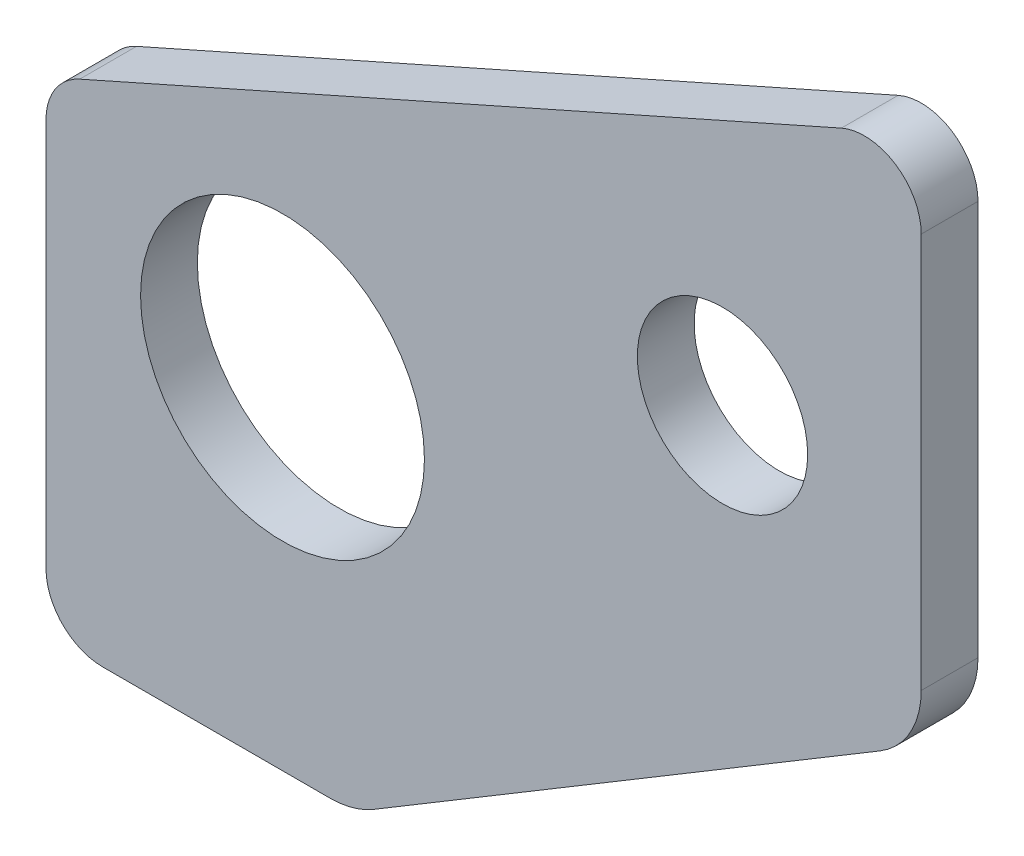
ISO-10303-21;
HEADER;
FILE_DESCRIPTION(('STEP AP214'),'2;1');
FILE_NAME('part.step','',(''),(''),'','','');
FILE_SCHEMA(('AUTOMOTIVE_DESIGN { 1 0 10303 214 1 1 1 1 }'));
ENDSEC;
DATA;
#1=APPLICATION_CONTEXT('core data for automotive mechanical design processes');
#2=APPLICATION_PROTOCOL_DEFINITION('international standard','automotive_design',2000,#1);
#3=PRODUCT_CONTEXT('',#1,'mechanical');
#4=PRODUCT('Part','Part','',(#3));
#5=PRODUCT_RELATED_PRODUCT_CATEGORY('part','',(#4));
#6=PRODUCT_DEFINITION_FORMATION('','',#4);
#7=PRODUCT_DEFINITION_CONTEXT('part definition',#1,'design');
#8=PRODUCT_DEFINITION('design','',#6,#7);
#9=PRODUCT_DEFINITION_SHAPE('','',#8);
#10=(LENGTH_UNIT() NAMED_UNIT(*) SI_UNIT(.MILLI.,.METRE.));
#11=(NAMED_UNIT(*) PLANE_ANGLE_UNIT() SI_UNIT($,.RADIAN.));
#12=(NAMED_UNIT(*) SI_UNIT($,.STERADIAN.) SOLID_ANGLE_UNIT());
#13=UNCERTAINTY_MEASURE_WITH_UNIT(LENGTH_MEASURE(1.E-05),#10,'distance_accuracy_value','');
#14=(GEOMETRIC_REPRESENTATION_CONTEXT(3) GLOBAL_UNCERTAINTY_ASSIGNED_CONTEXT((#13)) GLOBAL_UNIT_ASSIGNED_CONTEXT((#10,
#11,#12)) REPRESENTATION_CONTEXT('',''));
#15=CARTESIAN_POINT('',(0.,0.,0.));
#16=DIRECTION('',(0.,0.,1.));
#17=DIRECTION('',(1.,0.,0.));
#18=AXIS2_PLACEMENT_3D('',#15,#16,#17);
#19=CARTESIAN_POINT('',(-4.44619602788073,34.2489986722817,-2.));
#20=DIRECTION('',(0.,0.,1.));
#21=DIRECTION('',(1.,0.,0.));
#22=AXIS2_PLACEMENT_3D('',#19,#20,#21);
#23=CYLINDRICAL_SURFACE('',#22,3.00000000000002);
#24=CARTESIAN_POINT('',(-4.44619602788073,34.2489986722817,0.));
#25=DIRECTION('',(0.,0.,1.));
#26=DIRECTION('',(-1.,0.,0.));
#27=AXIS2_PLACEMENT_3D('',#24,#25,#26);
#28=CIRCLE('',#27,3.00000000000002);
#29=CARTESIAN_POINT('',(-4.44619602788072,31.2489986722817,0.));
#30=VERTEX_POINT('',#29);
#31=CARTESIAN_POINT('',(-2.90270876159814,31.676519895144,0.));
#32=VERTEX_POINT('',#31);
#33=EDGE_CURVE('E139',#30,#32,#28,.T.);
#34=ORIENTED_EDGE('',*,*,#33,.F.);
#35=DIRECTION('',(0.,0.,1.));
#36=VECTOR('',#35,1.);
#37=CARTESIAN_POINT('',(-4.44619602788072,31.2489986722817,-2.));
#38=LINE('',#37,#36);
#39=CARTESIAN_POINT('',(-4.44619602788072,31.2489986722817,-2.));
#40=VERTEX_POINT('',#39);
#41=EDGE_CURVE('E11',#40,#30,#38,.T.);
#42=ORIENTED_EDGE('',*,*,#41,.F.);
#43=CARTESIAN_POINT('',(-4.44619602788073,34.2489986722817,-2.));
#44=DIRECTION('',(0.,0.,1.));
#45=DIRECTION('',(-1.,0.,0.));
#46=AXIS2_PLACEMENT_3D('',#43,#44,#45);
#47=CIRCLE('',#46,3.00000000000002);
#48=CARTESIAN_POINT('',(-2.90270876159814,31.676519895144,-2.));
#49=VERTEX_POINT('',#48);
#50=EDGE_CURVE('E166',#40,#49,#47,.T.);
#51=ORIENTED_EDGE('',*,*,#50,.T.);
#52=DIRECTION('',(0.,0.,1.));
#53=VECTOR('',#52,1.);
#54=CARTESIAN_POINT('',(-2.90270876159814,31.676519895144,-2.));
#55=LINE('',#54,#53);
#56=EDGE_CURVE('E33',#49,#32,#55,.T.);
#57=ORIENTED_EDGE('',*,*,#56,.T.);
#58=EDGE_LOOP('',(#34,#42,#51,#57));
#59=FACE_BOUND('',#58,.T.);
#60=ADVANCED_FACE('F30',(#59),#23,.T.);
#61=CARTESIAN_POINT('',(-12.4461960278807,31.2489986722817,-2.));
#62=DIRECTION('',(0.,-1.,0.));
#63=DIRECTION('',(0.,0.,-1.));
#64=AXIS2_PLACEMENT_3D('',#61,#62,#63);
#65=PLANE('',#64);
#66=DIRECTION('',(1.,0.,0.));
#67=VECTOR('',#66,1.);
#68=CARTESIAN_POINT('',(-12.4461960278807,31.2489986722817,0.));
#69=LINE('',#68,#67);
#70=CARTESIAN_POINT('',(-12.4461960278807,31.2489986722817,0.));
#71=VERTEX_POINT('',#70);
#72=EDGE_CURVE('E164',#71,#30,#69,.T.);
#73=ORIENTED_EDGE('',*,*,#72,.F.);
#74=DIRECTION('',(0.,0.,1.));
#75=VECTOR('',#74,1.);
#76=CARTESIAN_POINT('',(-12.4461960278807,31.2489986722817,-2.));
#77=LINE('',#76,#75);
#78=CARTESIAN_POINT('',(-12.4461960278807,31.2489986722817,-2.));
#79=VERTEX_POINT('',#78);
#80=EDGE_CURVE('E39',#79,#71,#77,.T.);
#81=ORIENTED_EDGE('',*,*,#80,.F.);
#82=DIRECTION('',(1.,0.,0.));
#83=VECTOR('',#82,1.);
#84=CARTESIAN_POINT('',(-12.4461960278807,31.2489986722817,-2.));
#85=LINE('',#84,#83);
#86=EDGE_CURVE('E129',#79,#40,#85,.T.);
#87=ORIENTED_EDGE('',*,*,#86,.T.);
#88=ORIENTED_EDGE('',*,*,#41,.T.);
#89=EDGE_LOOP('',(#73,#81,#87,#88));
#90=FACE_BOUND('',#89,.T.);
#91=ADVANCED_FACE('F182',(#90),#65,.T.);
#92=CARTESIAN_POINT('',(-12.4461960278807,33.2489986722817,-2.));
#93=DIRECTION('',(0.,0.,1.));
#94=DIRECTION('',(1.,0.,0.));
#95=AXIS2_PLACEMENT_3D('',#92,#93,#94);
#96=CYLINDRICAL_SURFACE('',#95,2.00000000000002);
#97=CARTESIAN_POINT('',(-12.4461960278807,33.2489986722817,0.));
#98=DIRECTION('',(0.,0.,1.));
#99=DIRECTION('',(1.,0.,0.));
#100=AXIS2_PLACEMENT_3D('',#97,#98,#99);
#101=CIRCLE('',#100,2.00000000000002);
#102=CARTESIAN_POINT('',(-14.4461960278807,33.2489986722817,0.));
#103=VERTEX_POINT('',#102);
#104=EDGE_CURVE('E116',#103,#71,#101,.T.);
#105=ORIENTED_EDGE('',*,*,#104,.F.);
#106=DIRECTION('',(0.,0.,1.));
#107=VECTOR('',#106,1.);
#108=CARTESIAN_POINT('',(-14.4461960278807,33.2489986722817,-2.));
#109=LINE('',#108,#107);
#110=CARTESIAN_POINT('',(-14.4461960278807,33.2489986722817,-2.));
#111=VERTEX_POINT('',#110);
#112=EDGE_CURVE('E111',#111,#103,#109,.T.);
#113=ORIENTED_EDGE('',*,*,#112,.F.);
#114=CARTESIAN_POINT('',(-12.4461960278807,33.2489986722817,-2.));
#115=DIRECTION('',(0.,0.,1.));
#116=DIRECTION('',(1.,0.,0.));
#117=AXIS2_PLACEMENT_3D('',#114,#115,#116);
#118=CIRCLE('',#117,2.00000000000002);
#119=EDGE_CURVE('E114',#111,#79,#118,.T.);
#120=ORIENTED_EDGE('',*,*,#119,.T.);
#121=ORIENTED_EDGE('',*,*,#80,.T.);
#122=EDGE_LOOP('',(#105,#113,#120,#121));
#123=FACE_BOUND('',#122,.T.);
#124=ADVANCED_FACE('F113',(#123),#96,.T.);
#125=CARTESIAN_POINT('',(-14.4461960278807,46.9490955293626,-2.));
#126=DIRECTION('',(-1.,0.,0.));
#127=DIRECTION('',(0.,0.,1.));
#128=AXIS2_PLACEMENT_3D('',#125,#126,#127);
#129=PLANE('',#128);
#130=DIRECTION('',(0.,-1.,0.));
#131=VECTOR('',#130,1.);
#132=CARTESIAN_POINT('',(-14.4461960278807,46.9490955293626,0.));
#133=LINE('',#132,#131);
#134=CARTESIAN_POINT('',(-14.4461960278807,46.9490955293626,0.));
#135=VERTEX_POINT('',#134);
#136=EDGE_CURVE('E161',#135,#103,#133,.T.);
#137=ORIENTED_EDGE('',*,*,#136,.F.);
#138=DIRECTION('',(0.,0.,1.));
#139=VECTOR('',#138,1.);
#140=CARTESIAN_POINT('',(-14.4461960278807,46.9490955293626,-2.));
#141=LINE('',#140,#139);
#142=CARTESIAN_POINT('',(-14.4461960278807,46.9490955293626,-2.));
#143=VERTEX_POINT('',#142);
#144=EDGE_CURVE('E121',#143,#135,#141,.T.);
#145=ORIENTED_EDGE('',*,*,#144,.F.);
#146=DIRECTION('',(0.,-1.,0.));
#147=VECTOR('',#146,1.);
#148=CARTESIAN_POINT('',(-14.4461960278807,46.9490955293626,-2.));
#149=LINE('',#148,#147);
#150=EDGE_CURVE('E127',#143,#111,#149,.T.);
#151=ORIENTED_EDGE('',*,*,#150,.T.);
#152=ORIENTED_EDGE('',*,*,#112,.T.);
#153=EDGE_LOOP('',(#137,#145,#151,#152));
#154=FACE_BOUND('',#153,.T.);
#155=ADVANCED_FACE('F131',(#154),#129,.T.);
#156=CARTESIAN_POINT('',(-12.4461960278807,46.9490955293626,-2.));
#157=DIRECTION('',(0.,0.,1.));
#158=DIRECTION('',(1.,0.,0.));
#159=AXIS2_PLACEMENT_3D('',#156,#157,#158);
#160=CYLINDRICAL_SURFACE('',#159,2.00000000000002);
#161=CARTESIAN_POINT('',(-12.4461960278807,46.9490955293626,0.));
#162=DIRECTION('',(0.,0.,1.));
#163=DIRECTION('',(1.,0.,0.));
#164=AXIS2_PLACEMENT_3D('',#161,#162,#163);
#165=CIRCLE('',#164,2.00000000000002);
#166=CARTESIAN_POINT('',(-13.2582712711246,48.7768082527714,0.));
#167=VERTEX_POINT('',#166);
#168=EDGE_CURVE('E158',#167,#135,#165,.T.);
#169=ORIENTED_EDGE('',*,*,#168,.F.);
#170=DIRECTION('',(0.,0.,1.));
#171=VECTOR('',#170,1.);
#172=CARTESIAN_POINT('',(-13.2582712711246,48.7768082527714,-2.));
#173=LINE('',#172,#171);
#174=CARTESIAN_POINT('',(-13.2582712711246,48.7768082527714,-2.));
#175=VERTEX_POINT('',#174);
#176=EDGE_CURVE('E170',#175,#167,#173,.T.);
#177=ORIENTED_EDGE('',*,*,#176,.F.);
#178=CARTESIAN_POINT('',(-12.4461960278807,46.9490955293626,-2.));
#179=DIRECTION('',(0.,0.,1.));
#180=DIRECTION('',(1.,0.,0.));
#181=AXIS2_PLACEMENT_3D('',#178,#179,#180);
#182=CIRCLE('',#181,2.00000000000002);
#183=EDGE_CURVE('E132',#175,#143,#182,.T.);
#184=ORIENTED_EDGE('',*,*,#183,.T.);
#185=ORIENTED_EDGE('',*,*,#144,.T.);
#186=EDGE_LOOP('',(#169,#177,#184,#185));
#187=FACE_BOUND('',#186,.T.);
#188=ADVANCED_FACE('F195',(#187),#160,.T.);
#189=CARTESIAN_POINT('',(13.5726806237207,60.6981301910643,-2.));
#190=DIRECTION('',(-0.406037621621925,0.913856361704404,0.));
#191=DIRECTION('',(-0.913856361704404,-0.406037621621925,0.));
#192=AXIS2_PLACEMENT_3D('',#189,#190,#191);
#193=PLANE('',#192);
#194=DIRECTION('',(-0.913856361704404,-0.406037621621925,0.));
#195=VECTOR('',#194,1.);
#196=CARTESIAN_POINT('',(13.5726806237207,60.6981301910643,0.));
#197=LINE('',#196,#195);
#198=CARTESIAN_POINT('',(13.5726806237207,60.6981301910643,0.));
#199=VERTEX_POINT('',#198);
#200=EDGE_CURVE('E155',#199,#167,#197,.T.);
#201=ORIENTED_EDGE('',*,*,#200,.F.);
#202=DIRECTION('',(0.,0.,1.));
#203=VECTOR('',#202,1.);
#204=CARTESIAN_POINT('',(13.5726806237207,60.6981301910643,-2.));
#205=LINE('',#204,#203);
#206=CARTESIAN_POINT('',(13.5726806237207,60.6981301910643,-2.));
#207=VERTEX_POINT('',#206);
#208=EDGE_CURVE('E172',#207,#199,#205,.T.);
#209=ORIENTED_EDGE('',*,*,#208,.F.);
#210=DIRECTION('',(-0.913856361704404,-0.406037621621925,0.));
#211=VECTOR('',#210,1.);
#212=CARTESIAN_POINT('',(13.5726806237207,60.6981301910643,-2.));
#213=LINE('',#212,#211);
#214=EDGE_CURVE('E134',#207,#175,#213,.T.);
#215=ORIENTED_EDGE('',*,*,#214,.T.);
#216=ORIENTED_EDGE('',*,*,#176,.T.);
#217=EDGE_LOOP('',(#201,#209,#215,#216));
#218=FACE_BOUND('',#217,.T.);
#219=ADVANCED_FACE('F198',(#218),#193,.T.);
#220=CARTESIAN_POINT('',(14.3847558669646,58.8704174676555,-2.));
#221=DIRECTION('',(0.,0.,1.));
#222=DIRECTION('',(1.,0.,0.));
#223=AXIS2_PLACEMENT_3D('',#220,#221,#222);
#224=CYLINDRICAL_SURFACE('',#223,2.00000000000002);
#225=CARTESIAN_POINT('',(14.3847558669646,58.8704174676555,0.));
#226=DIRECTION('',(0.,0.,1.));
#227=DIRECTION('',(-1.,0.,0.));
#228=AXIS2_PLACEMENT_3D('',#225,#226,#227);
#229=CIRCLE('',#228,2.00000000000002);
#230=CARTESIAN_POINT('',(16.3847558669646,58.8704174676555,0.));
#231=VERTEX_POINT('',#230);
#232=EDGE_CURVE('E152',#231,#199,#229,.T.);
#233=ORIENTED_EDGE('',*,*,#232,.F.);
#234=DIRECTION('',(0.,0.,1.));
#235=VECTOR('',#234,1.);
#236=CARTESIAN_POINT('',(16.3847558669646,58.8704174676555,-2.));
#237=LINE('',#236,#235);
#238=CARTESIAN_POINT('',(16.3847558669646,58.8704174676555,-2.));
#239=VERTEX_POINT('',#238);
#240=EDGE_CURVE('E174',#239,#231,#237,.T.);
#241=ORIENTED_EDGE('',*,*,#240,.F.);
#242=CARTESIAN_POINT('',(14.3847558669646,58.8704174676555,-2.));
#243=DIRECTION('',(0.,0.,1.));
#244=DIRECTION('',(-1.,0.,0.));
#245=AXIS2_PLACEMENT_3D('',#242,#243,#244);
#246=CIRCLE('',#245,2.00000000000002);
#247=EDGE_CURVE('E258',#239,#207,#246,.T.);
#248=ORIENTED_EDGE('',*,*,#247,.T.);
#249=ORIENTED_EDGE('',*,*,#208,.T.);
#250=EDGE_LOOP('',(#233,#241,#248,#249));
#251=FACE_BOUND('',#250,.T.);
#252=ADVANCED_FACE('F202',(#251),#224,.T.);
#253=CARTESIAN_POINT('',(16.3847558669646,58.8704174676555,-2.));
#254=DIRECTION('',(1.,0.,0.));
#255=DIRECTION('',(0.,0.,-1.));
#256=AXIS2_PLACEMENT_3D('',#253,#254,#255);
#257=PLANE('',#256);
#258=DIRECTION('',(0.,1.,0.));
#259=VECTOR('',#258,1.);
#260=CARTESIAN_POINT('',(16.3847558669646,58.8704174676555,0.));
#261=LINE('',#260,#259);
#262=CARTESIAN_POINT('',(16.3847558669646,44.9475698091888,0.));
#263=VERTEX_POINT('',#262);
#264=EDGE_CURVE('E149',#263,#231,#261,.T.);
#265=ORIENTED_EDGE('',*,*,#264,.F.);
#266=DIRECTION('',(0.,0.,1.));
#267=VECTOR('',#266,1.);
#268=CARTESIAN_POINT('',(16.3847558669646,44.9475698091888,-2.));
#269=LINE('',#268,#267);
#270=CARTESIAN_POINT('',(16.3847558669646,44.9475698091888,-2.));
#271=VERTEX_POINT('',#270);
#272=EDGE_CURVE('E176',#271,#263,#269,.T.);
#273=ORIENTED_EDGE('',*,*,#272,.F.);
#274=DIRECTION('',(0.,1.,0.));
#275=VECTOR('',#274,1.);
#276=CARTESIAN_POINT('',(16.3847558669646,58.8704174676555,-2.));
#277=LINE('',#276,#275);
#278=EDGE_CURVE('E255',#271,#239,#277,.T.);
#279=ORIENTED_EDGE('',*,*,#278,.T.);
#280=ORIENTED_EDGE('',*,*,#240,.T.);
#281=EDGE_LOOP('',(#265,#273,#279,#280));
#282=FACE_BOUND('',#281,.T.);
#283=ADVANCED_FACE('F206',(#282),#257,.T.);
#284=CARTESIAN_POINT('',(13.3847558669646,44.9475698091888,-2.));
#285=DIRECTION('',(0.,0.,1.));
#286=DIRECTION('',(1.,0.,0.));
#287=AXIS2_PLACEMENT_3D('',#284,#285,#286);
#288=CYLINDRICAL_SURFACE('',#287,3.00000000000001);
#289=CARTESIAN_POINT('',(13.3847558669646,44.9475698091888,0.));
#290=DIRECTION('',(0.,0.,1.));
#291=DIRECTION('',(-1.,0.,0.));
#292=AXIS2_PLACEMENT_3D('',#289,#290,#291);
#293=CIRCLE('',#292,3.00000000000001);
#294=CARTESIAN_POINT('',(14.9282431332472,42.3750910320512,0.));
#295=VERTEX_POINT('',#294);
#296=EDGE_CURVE('E146',#295,#263,#293,.T.);
#297=ORIENTED_EDGE('',*,*,#296,.F.);
#298=DIRECTION('',(0.,0.,1.));
#299=VECTOR('',#298,1.);
#300=CARTESIAN_POINT('',(14.9282431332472,42.3750910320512,-2.));
#301=LINE('',#300,#299);
#302=CARTESIAN_POINT('',(14.9282431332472,42.3750910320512,-2.));
#303=VERTEX_POINT('',#302);
#304=EDGE_CURVE('E177',#303,#295,#301,.T.);
#305=ORIENTED_EDGE('',*,*,#304,.F.);
#306=CARTESIAN_POINT('',(13.3847558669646,44.9475698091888,-2.));
#307=DIRECTION('',(0.,0.,1.));
#308=DIRECTION('',(-1.,0.,0.));
#309=AXIS2_PLACEMENT_3D('',#306,#307,#308);
#310=CIRCLE('',#309,3.00000000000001);
#311=EDGE_CURVE('E252',#303,#271,#310,.T.);
#312=ORIENTED_EDGE('',*,*,#311,.T.);
#313=ORIENTED_EDGE('',*,*,#272,.T.);
#314=EDGE_LOOP('',(#297,#305,#312,#313));
#315=FACE_BOUND('',#314,.T.);
#316=ADVANCED_FACE('F210',(#315),#288,.T.);
#317=CARTESIAN_POINT('',(-2.90270876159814,31.676519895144,-2.));
#318=DIRECTION('',(0.514495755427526,-0.857492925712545,0.));
#319=DIRECTION('',(0.857492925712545,0.514495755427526,0.));
#320=AXIS2_PLACEMENT_3D('',#317,#318,#319);
#321=PLANE('',#320);
#322=DIRECTION('',(0.857492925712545,0.514495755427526,0.));
#323=VECTOR('',#322,1.);
#324=CARTESIAN_POINT('',(-2.90270876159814,31.676519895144,0.));
#325=LINE('',#324,#323);
#326=EDGE_CURVE('E142',#32,#295,#325,.T.);
#327=ORIENTED_EDGE('',*,*,#326,.F.);
#328=ORIENTED_EDGE('',*,*,#56,.F.);
#329=DIRECTION('',(0.857492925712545,0.514495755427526,0.));
#330=VECTOR('',#329,1.);
#331=CARTESIAN_POINT('',(-2.90270876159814,31.676519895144,-2.));
#332=LINE('',#331,#330);
#333=EDGE_CURVE('E250',#49,#303,#332,.T.);
#334=ORIENTED_EDGE('',*,*,#333,.T.);
#335=ORIENTED_EDGE('',*,*,#304,.T.);
#336=EDGE_LOOP('',(#327,#328,#334,#335));
#337=FACE_BOUND('',#336,.T.);
#338=ADVANCED_FACE('F179',(#337),#321,.T.);
#339=CARTESIAN_POINT('',(-4.44619602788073,34.2489986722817,-2.));
#340=DIRECTION('',(0.,0.,-1.));
#341=DIRECTION('',(-1.,0.,0.));
#342=AXIS2_PLACEMENT_3D('',#339,#340,#341);
#343=PLANE('',#342);
#344=CARTESIAN_POINT('',(9.38475586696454,50.1437222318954,-2.));
#345=DIRECTION('',(0.,0.,1.));
#346=DIRECTION('',(1.,0.,0.));
#347=AXIS2_PLACEMENT_3D('',#344,#345,#346);
#348=CIRCLE('',#347,3.);
#349=CARTESIAN_POINT('',(12.3847558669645,50.1437222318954,-2.));
#350=VERTEX_POINT('',#349);
#351=EDGE_CURVE('E237',#350,#350,#348,.T.);
#352=ORIENTED_EDGE('',*,*,#351,.T.);
#353=EDGE_LOOP('',(#352));
#354=FACE_BOUND('',#353,.T.);
#355=CARTESIAN_POINT('',(-6.11524413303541,43.2489986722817,-2.));
#356=DIRECTION('',(0.,0.,1.));
#357=DIRECTION('',(1.,0.,0.));
#358=AXIS2_PLACEMENT_3D('',#355,#356,#357);
#359=CIRCLE('',#358,5.);
#360=CARTESIAN_POINT('',(-1.11524413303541,43.2489986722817,-2.));
#361=VERTEX_POINT('',#360);
#362=EDGE_CURVE('E143',#361,#361,#359,.T.);
#363=ORIENTED_EDGE('',*,*,#362,.T.);
#364=EDGE_LOOP('',(#363));
#365=FACE_BOUND('',#364,.T.);
#366=ORIENTED_EDGE('',*,*,#50,.F.);
#367=ORIENTED_EDGE('',*,*,#86,.F.);
#368=ORIENTED_EDGE('',*,*,#119,.F.);
#369=ORIENTED_EDGE('',*,*,#150,.F.);
#370=ORIENTED_EDGE('',*,*,#183,.F.);
#371=ORIENTED_EDGE('',*,*,#214,.F.);
#372=ORIENTED_EDGE('',*,*,#247,.F.);
#373=ORIENTED_EDGE('',*,*,#278,.F.);
#374=ORIENTED_EDGE('',*,*,#311,.F.);
#375=ORIENTED_EDGE('',*,*,#333,.F.);
#376=EDGE_LOOP('',(#366,#367,#368,#369,#370,#371,#372,#373,#374,#375));
#377=FACE_BOUND('',#376,.T.);
#378=ADVANCED_FACE('F125',(#354,#365,#377),#343,.T.);
#379=CARTESIAN_POINT('',(-4.44619602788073,34.2489986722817,0.));
#380=DIRECTION('',(0.,0.,-1.));
#381=DIRECTION('',(-1.,0.,0.));
#382=AXIS2_PLACEMENT_3D('',#379,#380,#381);
#383=PLANE('',#382);
#384=CARTESIAN_POINT('',(9.38475586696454,50.1437222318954,0.));
#385=DIRECTION('',(0.,0.,1.));
#386=DIRECTION('',(1.,0.,0.));
#387=AXIS2_PLACEMENT_3D('',#384,#385,#386);
#388=CIRCLE('',#387,3.);
#389=CARTESIAN_POINT('',(12.3847558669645,50.1437222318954,0.));
#390=VERTEX_POINT('',#389);
#391=EDGE_CURVE('E240',#390,#390,#388,.T.);
#392=ORIENTED_EDGE('',*,*,#391,.F.);
#393=EDGE_LOOP('',(#392));
#394=FACE_BOUND('',#393,.T.);
#395=CARTESIAN_POINT('',(-6.11524413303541,43.2489986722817,0.));
#396=DIRECTION('',(0.,0.,1.));
#397=DIRECTION('',(1.,0.,0.));
#398=AXIS2_PLACEMENT_3D('',#395,#396,#397);
#399=CIRCLE('',#398,5.);
#400=CARTESIAN_POINT('',(-1.11524413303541,43.2489986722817,0.));
#401=VERTEX_POINT('',#400);
#402=EDGE_CURVE('E242',#401,#401,#399,.T.);
#403=ORIENTED_EDGE('',*,*,#402,.F.);
#404=EDGE_LOOP('',(#403));
#405=FACE_BOUND('',#404,.T.);
#406=ORIENTED_EDGE('',*,*,#33,.T.);
#407=ORIENTED_EDGE('',*,*,#326,.T.);
#408=ORIENTED_EDGE('',*,*,#296,.T.);
#409=ORIENTED_EDGE('',*,*,#264,.T.);
#410=ORIENTED_EDGE('',*,*,#232,.T.);
#411=ORIENTED_EDGE('',*,*,#200,.T.);
#412=ORIENTED_EDGE('',*,*,#168,.T.);
#413=ORIENTED_EDGE('',*,*,#136,.T.);
#414=ORIENTED_EDGE('',*,*,#104,.T.);
#415=ORIENTED_EDGE('',*,*,#72,.T.);
#416=EDGE_LOOP('',(#406,#407,#408,#409,#410,#411,#412,#413,#414,#415));
#417=FACE_BOUND('',#416,.T.);
#418=ADVANCED_FACE('F181',(#394,#405,#417),#383,.F.);
#419=CARTESIAN_POINT('',(-6.11524413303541,43.2489986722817,-2.));
#420=DIRECTION('',(0.,0.,1.));
#421=DIRECTION('',(1.,0.,0.));
#422=AXIS2_PLACEMENT_3D('',#419,#420,#421);
#423=CYLINDRICAL_SURFACE('',#422,5.);
#424=ORIENTED_EDGE('',*,*,#362,.F.);
#425=EDGE_LOOP('',(#424));
#426=FACE_BOUND('',#425,.T.);
#427=ORIENTED_EDGE('',*,*,#402,.T.);
#428=EDGE_LOOP('',(#427));
#429=FACE_BOUND('',#428,.T.);
#430=ADVANCED_FACE('F222',(#426,#429),#423,.F.);
#431=CARTESIAN_POINT('',(9.38475586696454,50.1437222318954,-2.));
#432=DIRECTION('',(0.,0.,1.));
#433=DIRECTION('',(1.,0.,0.));
#434=AXIS2_PLACEMENT_3D('',#431,#432,#433);
#435=CYLINDRICAL_SURFACE('',#434,3.);
#436=ORIENTED_EDGE('',*,*,#351,.F.);
#437=EDGE_LOOP('',(#436));
#438=FACE_BOUND('',#437,.T.);
#439=ORIENTED_EDGE('',*,*,#391,.T.);
#440=EDGE_LOOP('',(#439));
#441=FACE_BOUND('',#440,.T.);
#442=ADVANCED_FACE('F229',(#438,#441),#435,.F.);
#443=CLOSED_SHELL('',(#60,#91,#124,#155,#188,#219,#252,#283,#316,#338,#378,#418,#430,#442));
#444=MANIFOLD_SOLID_BREP('B2',#443);
#445=ADVANCED_BREP_SHAPE_REPRESENTATION('',(#18,#444),#14);
#446=SHAPE_DEFINITION_REPRESENTATION(#9,#445);
ENDSEC;
END-ISO-10303-21;
